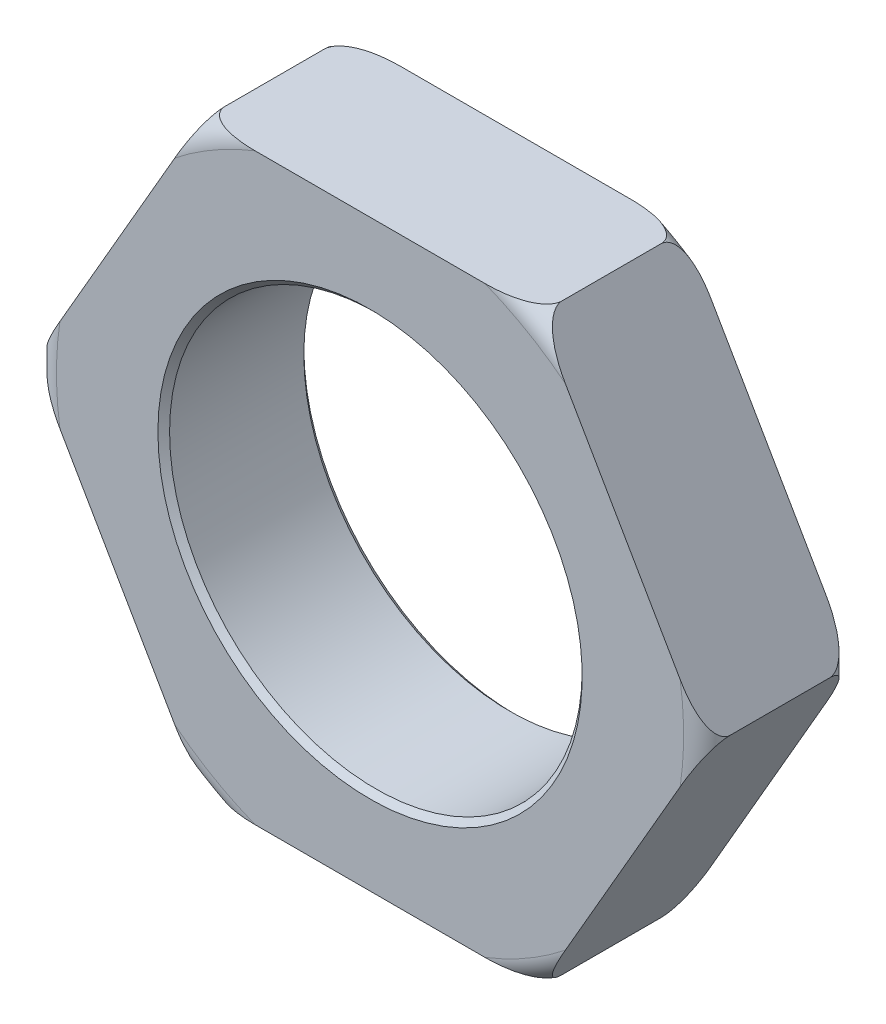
from build123d import *

# Parameters (mm, degrees)
BASE_EXTRUDE_DEPTH = 6.35
SKETCH3_R          = 8.9789
CUT_EXTRUDE1_DEPTH = 21.412394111
CHAMFER1_SIZE      = 0.254


with BuildPart() as part:
    # Sketch1 → Base-Extrude (new body)
    with BuildSketch(Plane.XY):
        Polygon((14.664696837, 0), (7.332348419, 12.7), (-7.332348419, 12.7), (-14.664696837, 0), (-7.332348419, -12.7), (7.332348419, -12.7), align=None)
    extrude(amount=-BASE_EXTRUDE_DEPTH)

    # Sketch3 → Cut-Extrude1 (cut, through all)
    with BuildSketch(Plane.XY):
        with Locations(Location((0, 0, 0), (0, 0, 180))):
            Circle(SKETCH3_R)
    extrude(amount=-CUT_EXTRUDE1_DEPTH, mode=Mode.SUBTRACT)

    # Chamfer1
    chamfer1_edges = [part.edges().sort_by_distance(p)[0] for p in [
        (8.9789, 0, 0),
        (8.9789, 0, -6.35),
    ]]
    chamfer(chamfer1_edges, length=CHAMFER1_SIZE)

    # Sketch4 → Cut-Revolve1 (revolve, cut)
    with BuildSketch(Plane(origin=(0, 0, 0), x_dir=(1, 0, 0), z_dir=(0, 1, 0))):
        with BuildLine():
            Line((-14.664696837, 5.334), (-14.664696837, 1.016))
            ThreePointArc((-14.664696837, 1.016), (-14.367117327, 0.29757951), (-13.648696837, 0))
            Line((-13.648696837, 0), (-7.332348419, 0))
            Line((-7.332348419, 0), (-7.332348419, -2.480952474))
            Line((-7.332348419, -2.480952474), (-16.116805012, -2.480952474))
            Line((-16.116805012, -2.480952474), (-16.116805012, 9.540162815))
            Line((-16.116805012, 9.540162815), (-7.332348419, 9.540162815))
            Line((-7.332348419, 9.540162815), (-7.332348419, 6.35))
            Line((-7.332348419, 6.35), (-13.648696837, 6.35))
            ThreePointArc((-13.648696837, 6.35), (-14.367117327, 6.05242049), (-14.664696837, 5.334))
        make_face()
    revolve(axis=Axis((0, 0, -10.768152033), (0, 0, 1)), mode=Mode.SUBTRACT)


solid = part.part
